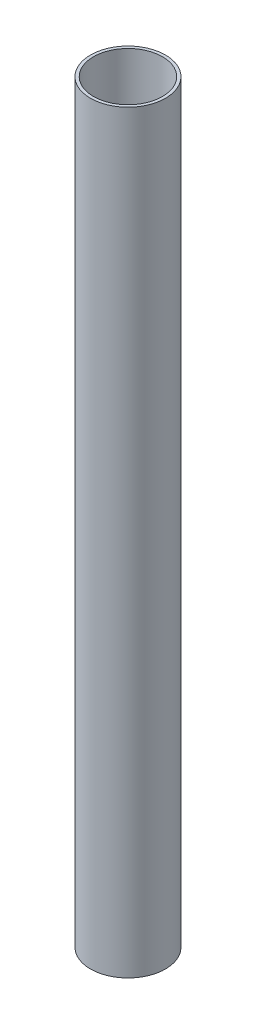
from build123d import *

# Parameters (mm, degrees)
SKETCH1_R           = 11.1125
SKETCH1_R_2         = 10.2235
EXTRUDE_THIN1_DEPTH = 111.76


with BuildPart() as part:
    # Sketch1 → Extrude-Thin1 (new, symmetric)
    with BuildSketch(Plane(origin=(0, 0, 0), x_dir=(1, 0, 0), z_dir=(0, 1, 0))):
        Circle(SKETCH1_R)
        Circle(SKETCH1_R_2, mode=Mode.SUBTRACT)
    extrude(amount=EXTRUDE_THIN1_DEPTH, both=True)


solid = part.part
